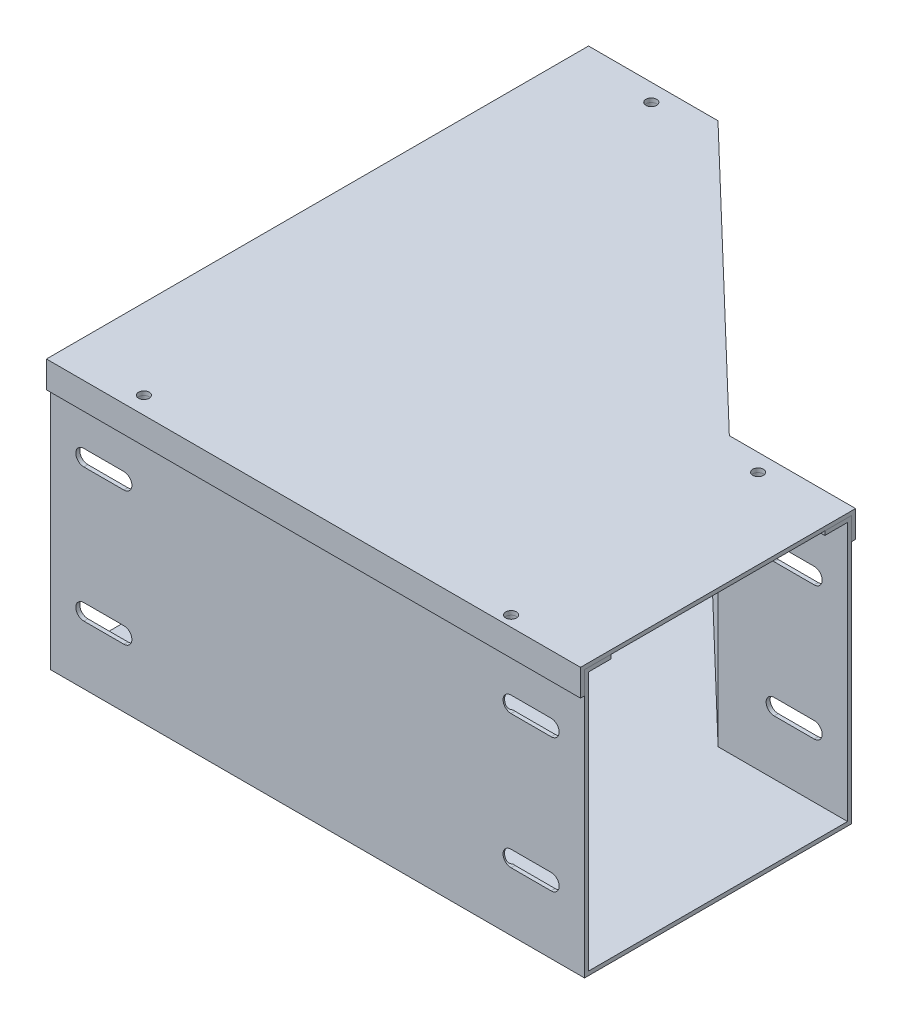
from build123d import *

# Parameters (mm, degrees)
BOSS_EXTRUDE1_DEPTH     = 1.5
EXTRUDE_THIN1_DEPTH     = 100
CUT_EXTRUDE1_DEPTH      = 188.082869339
CUT_EXTRUDE1_DEPTH_BACK = 188.082869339
EXTRUDE_THIN2_DEPTH     = 1.5
CUT_EXTRUDE2_REACH      = 208.155
SKETCH5_R               = 2
BOSS_EXTRUDE2_DEPTH     = 1.5
EXTRUDE_THIN3_DEPTH     = 10
SKETCH8_R               = 2
CUT_EXTRUDE3_DEPTH      = 1.5


with BuildPart() as part:
    # Sketch1 → Boss-Extrude1 (new body)
    with BuildSketch(Plane(origin=(0, -50, 0), x_dir=(1, 0, 0), z_dir=(0, 1, 0))):
        Polygon((100, 50), (100, -50), (52.123663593, -50), (-52.123663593, -50), (-100, -50), (-100, 150), (-52.123663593, 150), (52.123663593, 50), align=None)
    extrude(amount=BOSS_EXTRUDE1_DEPTH)

    # Sketch2 → Extrude-Thin1 (add)
    with BuildSketch(Plane(origin=(0, -50, 0), x_dir=(-1, 0, 0), z_dir=(0, -1, 0))):
        Polygon((100, 150), (52.123663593, 150), (-52.123663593, 50), (-100, 50), (-100, 48.5), (-51.520535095, 48.5), (52.72679209, 148.5), (100, 148.5), align=None)
        Polygon((-100, -50), (-52.123663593, -50), (52.123663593, -50), (100, -50), (100, -48.5), (52.123663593, -48.5), (-52.123663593, -48.5), (-100, -48.5), align=None)
    extrude(amount=-EXTRUDE_THIN1_DEPTH)

    # Sketch3 → Cut-Extrude1 (cut, two sides: drawn at the far end of the back side and taken through both)
    with BuildSketch(Plane.XY.offset(-CUT_EXTRUDE1_DEPTH_BACK)):
        with BuildLine():
            Line((72.5, 28), (87.5, 28))
            ThreePointArc((87.5, 28), (90.5, 25), (87.5, 22))
            Line((87.5, 22), (72.5, 22))
            ThreePointArc((72.5, 22), (69.5, 25), (72.5, 28))
        make_face()
        with BuildLine():
            Line((72.5, -22), (87.5, -22))
            ThreePointArc((87.5, -22), (90.5, -25), (87.5, -28))
            Line((87.5, -28), (72.5, -28))
            ThreePointArc((72.5, -28), (69.5, -25), (72.5, -22))
        make_face()
        with BuildLine():
            Line((-87.5, 28), (-72.5, 28))
            ThreePointArc((-72.5, 28), (-69.5, 25), (-72.5, 22))
            Line((-72.5, 22), (-87.5, 22))
            ThreePointArc((-87.5, 22), (-90.5, 25), (-87.5, 28))
        make_face()
        with BuildLine():
            Line((-87.5, -22), (-72.5, -22))
            ThreePointArc((-72.5, -22), (-69.5, -25), (-72.5, -28))
            Line((-72.5, -28), (-87.5, -28))
            ThreePointArc((-87.5, -28), (-90.5, -25), (-87.5, -22))
        make_face()
    extrude(amount=CUT_EXTRUDE1_DEPTH + CUT_EXTRUDE1_DEPTH_BACK, mode=Mode.SUBTRACT)

    # Sketch4 → Extrude-Thin2 (add)
    with BuildSketch(Plane(origin=(0, 50, 0), x_dir=(1, 0, 0), z_dir=(0, 1, 0))):
        Polygon((100, 50), (52.123663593, 50), (-52.123663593, 150), (-100, 150), (-100, 140), (-56.144520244, 140), (48.102806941, 40), (100, 40), align=None)
        Polygon((-100, -50), (-52.123663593, -50), (52.123663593, -50), (100, -50), (100, -40), (52.123663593, -40), (-52.123663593, -40), (-100, -40), align=None)
    extrude(amount=-EXTRUDE_THIN2_DEPTH)

    # Sketch5 → Cut-Extrude2 (cut, up to next)
    with BuildSketch(Plane(origin=(0, 50, 0), x_dir=(1, 0, 0), z_dir=(0, 1, 0)), mode=Mode.PRIVATE) as cut_extrude2_sk1:
        with Locations(Location((-70, 145, 0), (0, 0, 270))):
            Circle(SKETCH5_R)
    cut_extrude2_tool1 = extrude(cut_extrude2_sk1.sketch, amount=-CUT_EXTRUDE2_REACH, mode=Mode.PRIVATE) & part.part
    # Sketch5 → Cut-Extrude2 (cut, up to next)
    with BuildSketch(Plane(origin=(0, 50, 0), x_dir=(1, 0, 0), z_dir=(0, 1, 0)), mode=Mode.PRIVATE) as cut_extrude2_sk2:
        with Locations(Location((-70, -45, 0), (0, 0, 270))):
            Circle(SKETCH5_R)
    cut_extrude2_tool2 = extrude(cut_extrude2_sk2.sketch, amount=-CUT_EXTRUDE2_REACH, mode=Mode.PRIVATE) & part.part
    # Sketch5 → Cut-Extrude2 (cut, up to next)
    with BuildSketch(Plane(origin=(0, 50, 0), x_dir=(1, 0, 0), z_dir=(0, 1, 0)), mode=Mode.PRIVATE) as cut_extrude2_sk3:
        with Locations(Location((70, 45, 0), (0, 0, 270))):
            Circle(SKETCH5_R)
    cut_extrude2_tool3 = extrude(cut_extrude2_sk3.sketch, amount=-CUT_EXTRUDE2_REACH, mode=Mode.PRIVATE) & part.part
    # Sketch5 → Cut-Extrude2 (cut, up to next)
    with BuildSketch(Plane(origin=(0, 50, 0), x_dir=(1, 0, 0), z_dir=(0, 1, 0)), mode=Mode.PRIVATE) as cut_extrude2_sk4:
        with Locations(Location((70, -47.5, 0), (0, 0, 270))):
            Circle(SKETCH5_R)
    cut_extrude2_tool4 = extrude(cut_extrude2_sk4.sketch, amount=-CUT_EXTRUDE2_REACH, mode=Mode.PRIVATE) & part.part
    add(cut_extrude2_tool1.solids().sort_by_distance((-70, 50, -145))[0], mode=Mode.SUBTRACT)
    add(cut_extrude2_tool2.solids().sort_by_distance((-70, 50, 45))[0], mode=Mode.SUBTRACT)
    add(cut_extrude2_tool3.solids().sort_by_distance((70, 50, -45))[0], mode=Mode.SUBTRACT)
    add(cut_extrude2_tool4.solids().sort_by_distance((70, 50, 47.5))[0], mode=Mode.SUBTRACT)


with BuildPart() as body_2:
    # Sketch6 → Boss-Extrude2 (new body)
    with BuildSketch(Plane(origin=(0, 50, 0), x_dir=(1, 0, 0), z_dir=(0, 1, 0))):
        Polygon((-52.123663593, -50), (52.123663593, -50), (100, -50), (100, 50), (52.123663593, 50), (-52.123663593, 150), (-100, 150), (-100, -50), align=None)
    extrude(amount=BOSS_EXTRUDE2_DEPTH)

    # Sketch7 → Extrude-Thin3 (add)
    with BuildSketch(Plane(origin=(0, 51.5, 0), x_dir=(1, 0, 0), z_dir=(0, 1, 0))):
        Polygon((100, 50), (52.123663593, 50), (-52.123663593, 150), (-100, 150), (-100, 151.5), (-51.520535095, 151.5), (52.72679209, 51.5), (100, 51.5), align=None)
        Polygon((-100, -50), (-52.123663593, -50), (52.123663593, -50), (100, -50), (100, -51.5), (52.123663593, -51.5), (-52.123663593, -51.5), (-100, -51.5), align=None)
    extrude(amount=-EXTRUDE_THIN3_DEPTH)

    # Sketch8 → Cut-Extrude3 (cut)
    with BuildSketch(Plane(origin=(0, 51.5, 0), x_dir=(1, 0, 0), z_dir=(0, 1, 0))):
        with Locations(Location((70, -47.5, 0), (0, 0, 270))):
            Circle(SKETCH8_R)
        with Locations(Location((70, 45, 0), (0, 0, 270))):
            Circle(SKETCH8_R)
        with Locations(Location((-70, -45, 0), (0, 0, 270))):
            Circle(SKETCH8_R)
        with Locations(Location((-70, 145, 0), (0, 0, 270))):
            Circle(SKETCH8_R)
    extrude(amount=-CUT_EXTRUDE3_DEPTH, mode=Mode.SUBTRACT)


solid = Compound([part.part, body_2.part])
